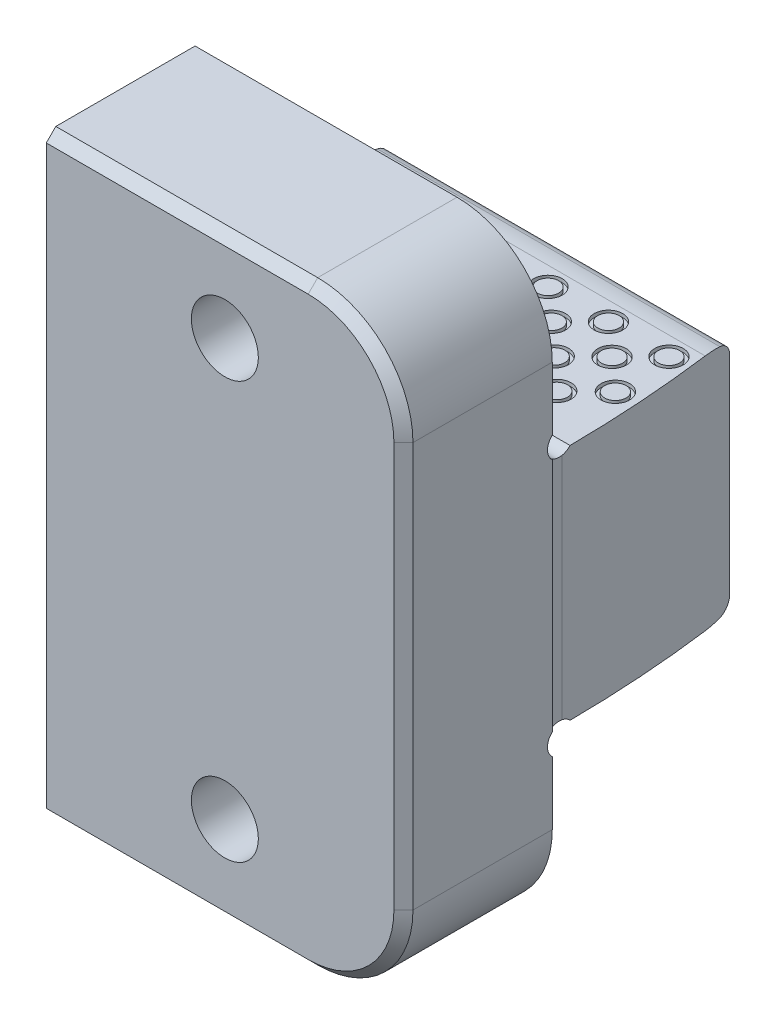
from build123d import *

# Parameters (mm, degrees)
EXTRUDE1_DEPTH             = 19.05
SKETCH7_W                  = 21.968267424
SKETCH7_H                  = 31.720833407
CUT_EXTRUDE3_DEPTH         = 0.254
SKETCH8_R                  = 1.524
CUT_EXTRUDE4_DEPTH         = 54.732233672
CUT_EXTRUDE5_DEPTH         = 54.732233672
CUT_EXTRUDE6_DEPTH         = 70.445179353
SKETCH15_R                 = 1.524
SKETCH15_R_2               = 1.143
CUT_EXTRUDE7_DEPTH         = 0.381
F_1_4_20_CBORE_D           = 7.14248
F_1_4_20_CBORE_CBORE_D     = 11.1125
F_1_4_20_CBORE_CBORE_DEPTH = 7.14502
FILLET1_R                  = 10.16
CHAMFER1_SIZE              = 1.016


with BuildPart() as part:
    # Sketch3 → Extrude1 (new, symmetric)
    with BuildSketch(Plane(origin=(0, 0, 0), x_dir=(0, 0, -1), z_dir=(1, 0, 0))):
        Polygon((-15.875, -31.75), (0, -31.75), (0, -12.69746), (20.6756, -12.69746), (20.6756, 12.69746), (0, 12.69746), (0, 31.75), (-15.875, 31.75), align=None)
    extrude(amount=EXTRUDE1_DEPTH, both=True)

    # Sketch7 → Cut-Extrude3 (cut)
    with BuildSketch(Plane(origin=(19.05, 0, 0), x_dir=(0, 0, -1), z_dir=(1, 0, 0))):
        with Locations((10.984133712, 1.307835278)):
            Rectangle(SKETCH7_W, SKETCH7_H)
    extrude(amount=-CUT_EXTRUDE3_DEPTH, mode=Mode.SUBTRACT)

    # Sketch8 → Cut-Extrude4 (cut, through all)
    with BuildSketch(Plane(origin=(19.05, 0, 0), x_dir=(0, 0, -1), z_dir=(1, 0, 0))):
        with Locations((1.016, 13.71346)):
            Circle(SKETCH8_R)
        with Locations((1.016, -13.71346)):
            Circle(SKETCH8_R)
    extrude(amount=-CUT_EXTRUDE4_DEPTH, mode=Mode.SUBTRACT)

    # Sketch9 → Cut-Extrude5 (cut, through all)
    with BuildSketch(Plane(origin=(19.05, 0, 0), x_dir=(0, 0, -1), z_dir=(1, 0, 0))):
        with BuildLine():
            Line((20.6756, 11.026976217), (23.9776, 11.026976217))
            Line((23.9776, 11.026976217), (23.9776, 17.376976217))
            Line((23.9776, 17.376976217), (17.6276, 17.376976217))
            Line((17.6276, 17.376976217), (17.6276, 12.69746))
            ThreePointArc((17.6276, 12.69746), (18.538923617, 12.653763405), (19.441885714, 12.523074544))
            ThreePointArc((19.441885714, 12.523074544), (20.327391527, 11.996558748), (20.6756, 11.026976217))
        make_face()
        with BuildLine():
            Line((23.9776, -11.026976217), (23.9776, -17.376976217))
            Line((23.9776, -17.376976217), (17.6276, -17.376976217))
            Line((17.6276, -17.376976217), (17.6276, -12.69746))
            ThreePointArc((17.6276, -12.69746), (18.538923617, -12.653763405), (19.441885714, -12.523074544))
            ThreePointArc((19.441885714, -12.523074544), (20.327391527, -11.996558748), (20.6756, -11.026976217))
            Line((20.6756, -11.026976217), (23.9776, -11.026976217))
        make_face()
    extrude(amount=-CUT_EXTRUDE5_DEPTH, mode=Mode.SUBTRACT)

    # Sketch13 → Cut-Extrude6 (cut, through all)
    with BuildSketch(Plane(origin=(0, 31.75, 0), x_dir=(1, 0, 0), z_dir=(0, 1, 0))):
        with BuildLine():
            Line((16.230078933, 26.67), (28.930078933, 26.67))
            Line((28.930078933, 26.67), (28.930078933, 1.27))
            Line((28.930078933, 1.27), (18.796, 1.27))
            ThreePointArc((18.796, 1.27), (18.152891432, 14.034638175), (16.230078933, 26.67))
        make_face()
    extrude(amount=-CUT_EXTRUDE6_DEPTH, mode=Mode.SUBTRACT)

    # Sketch15 → Cut-Extrude7 (cut)
    # profile 1 of 22: a face of its own
    with BuildSketch(Plane(origin=(0, 12.69746, 0), x_dir=(1, 0, 0), z_dir=(0, 1, 0))):
        with Locations(Location((-9.9314, 15.621, 0), (0, 0, 270))):
            Circle(SKETCH15_R)
        with Locations(Location((-9.9314, 15.621, 0), (0, 0, 270))):
            Circle(SKETCH15_R_2, mode=Mode.SUBTRACT)
    # profile 2 of 22: a face of its own
    with BuildSketch(Plane(origin=(0, 12.69746, 0), x_dir=(1, 0, 0), z_dir=(0, 1, 0))):
        with Locations(Location((-3.4798, 15.621, 0), (0, 0, 270))):
            Circle(SKETCH15_R)
        with Locations(Location((-3.4798, 15.621, 0), (0, 0, 270))):
            Circle(SKETCH15_R_2, mode=Mode.SUBTRACT)
    # profile 3 of 22: a face of its own
    with BuildSketch(Plane(origin=(0, 12.69746, 0), x_dir=(1, 0, 0), z_dir=(0, 1, 0))):
        with Locations(Location((-16.383, 15.621, 0), (0, 0, 270))):
            Circle(SKETCH15_R)
        with Locations(Location((-16.383, 15.621, 0), (0, 0, 270))):
            Circle(SKETCH15_R_2, mode=Mode.SUBTRACT)
    # profile 4 of 22: a face of its own
    with BuildSketch(Plane(origin=(0, 12.69746, 0), x_dir=(1, 0, 0), z_dir=(0, 1, 0))):
        with Locations(Location((15.875, 15.621, 0), (0, 0, 270))):
            Circle(SKETCH15_R)
        with Locations(Location((15.875, 15.621, 0), (0, 0, 270))):
            Circle(SKETCH15_R_2, mode=Mode.SUBTRACT)
    # profile 5 of 22: a face of its own
    with BuildSketch(Plane(origin=(0, 12.69746, 0), x_dir=(1, 0, 0), z_dir=(0, 1, 0))):
        with Locations(Location((9.4234, 15.621, 0), (0, 0, 270))):
            Circle(SKETCH15_R)
        with Locations(Location((9.4234, 15.621, 0), (0, 0, 270))):
            Circle(SKETCH15_R_2, mode=Mode.SUBTRACT)
    # profile 6 of 22: a face of its own
    with BuildSketch(Plane(origin=(0, 12.69746, 0), x_dir=(1, 0, 0), z_dir=(0, 1, 0))):
        with Locations(Location((2.9718, 15.621, 0), (0, 0, 270))):
            Circle(SKETCH15_R)
        with Locations(Location((2.9718, 15.621, 0), (0, 0, 270))):
            Circle(SKETCH15_R_2, mode=Mode.SUBTRACT)
    # profile 7 of 22: a face of its own
    with BuildSketch(Plane(origin=(0, 12.69746, 0), x_dir=(1, 0, 0), z_dir=(0, 1, 0))):
        with Locations(Location((-6.5786, 12.573, 0), (0, 0, 270))):
            Circle(SKETCH15_R)
        with Locations(Location((-6.5786, 12.573, 0), (0, 0, 270))):
            Circle(SKETCH15_R_2, mode=Mode.SUBTRACT)
    # profile 8 of 22: a face of its own
    with BuildSketch(Plane(origin=(0, 12.69746, 0), x_dir=(1, 0, 0), z_dir=(0, 1, 0))):
        with Locations(Location((-0.1016, 12.573, 0), (0, 0, 270))):
            Circle(SKETCH15_R)
        with Locations(Location((-0.1016, 12.573, 0), (0, 0, 270))):
            Circle(SKETCH15_R_2, mode=Mode.SUBTRACT)
    # profile 9 of 22: a face of its own
    with BuildSketch(Plane(origin=(0, 12.69746, 0), x_dir=(1, 0, 0), z_dir=(0, 1, 0))):
        with Locations(Location((-13.0556, 12.573, 0), (0, 0, 270))):
            Circle(SKETCH15_R)
        with Locations(Location((-13.0556, 12.573, 0), (0, 0, 270))):
            Circle(SKETCH15_R_2, mode=Mode.SUBTRACT)
    # profile 10 of 22: a face of its own
    with BuildSketch(Plane(origin=(0, 12.69746, 0), x_dir=(1, 0, 0), z_dir=(0, 1, 0))):
        with Locations(Location((12.8524, 12.573, 0), (0, 0, 270))):
            Circle(SKETCH15_R)
        with Locations(Location((12.8524, 12.573, 0), (0, 0, 270))):
            Circle(SKETCH15_R_2, mode=Mode.SUBTRACT)
    # profile 11 of 22: a face of its own
    with BuildSketch(Plane(origin=(0, 12.69746, 0), x_dir=(1, 0, 0), z_dir=(0, 1, 0))):
        with Locations(Location((6.3754, 12.573, 0), (0, 0, 270))):
            Circle(SKETCH15_R)
        with Locations(Location((6.3754, 12.573, 0), (0, 0, 270))):
            Circle(SKETCH15_R_2, mode=Mode.SUBTRACT)
    # profile 12 of 22: a face of its own
    with BuildSketch(Plane(origin=(0, 12.69746, 0), x_dir=(1, 0, 0), z_dir=(0, 1, 0))):
        with Locations(Location((-9.8552, 9.525, 0), (0, 0, 270))):
            Circle(SKETCH15_R)
        with Locations(Location((-9.8552, 9.525, 0), (0, 0, 270))):
            Circle(SKETCH15_R_2, mode=Mode.SUBTRACT)
    # profile 13 of 22: a face of its own
    with BuildSketch(Plane(origin=(0, 12.69746, 0), x_dir=(1, 0, 0), z_dir=(0, 1, 0))):
        with Locations(Location((-3.3274, 9.525, 0), (0, 0, 270))):
            Circle(SKETCH15_R)
        with Locations(Location((-3.3274, 9.525, 0), (0, 0, 270))):
            Circle(SKETCH15_R_2, mode=Mode.SUBTRACT)
    # profile 14 of 22: a face of its own
    with BuildSketch(Plane(origin=(0, 12.69746, 0), x_dir=(1, 0, 0), z_dir=(0, 1, 0))):
        with Locations(Location((-16.383, 9.525, 0), (0, 0, 270))):
            Circle(SKETCH15_R)
        with Locations(Location((-16.383, 9.525, 0), (0, 0, 270))):
            Circle(SKETCH15_R_2, mode=Mode.SUBTRACT)
    # profile 15 of 22: a face of its own
    with BuildSketch(Plane(origin=(0, 12.69746, 0), x_dir=(1, 0, 0), z_dir=(0, 1, 0))):
        with Locations(Location((16.256, 9.525, 0), (0, 0, 270))):
            Circle(SKETCH15_R)
        with Locations(Location((16.256, 9.525, 0), (0, 0, 270))):
            Circle(SKETCH15_R_2, mode=Mode.SUBTRACT)
    # profile 16 of 22: a face of its own
    with BuildSketch(Plane(origin=(0, 12.69746, 0), x_dir=(1, 0, 0), z_dir=(0, 1, 0))):
        with Locations(Location((9.7282, 9.525, 0), (0, 0, 270))):
            Circle(SKETCH15_R)
        with Locations(Location((9.7282, 9.525, 0), (0, 0, 270))):
            Circle(SKETCH15_R_2, mode=Mode.SUBTRACT)
    # profile 17 of 22: a face of its own
    with BuildSketch(Plane(origin=(0, 12.69746, 0), x_dir=(1, 0, 0), z_dir=(0, 1, 0))):
        with Locations(Location((3.2004, 9.525, 0), (0, 0, 270))):
            Circle(SKETCH15_R)
        with Locations(Location((3.2004, 9.525, 0), (0, 0, 270))):
            Circle(SKETCH15_R_2, mode=Mode.SUBTRACT)
    # profile 18 of 22: a face of its own
    with BuildSketch(Plane(origin=(0, 12.69746, 0), x_dir=(1, 0, 0), z_dir=(0, 1, 0))):
        with Locations(Location((-6.5278, 6.477, 0), (0, 0, 270))):
            Circle(SKETCH15_R)
        with Locations(Location((-6.5278, 6.477, 0), (0, 0, 270))):
            Circle(SKETCH15_R_2, mode=Mode.SUBTRACT)
    # profile 19 of 22: a face of its own
    with BuildSketch(Plane(origin=(0, 12.69746, 0), x_dir=(1, 0, 0), z_dir=(0, 1, 0))):
        with Locations(Location((0, 6.477, 0), (0, 0, 270))):
            Circle(SKETCH15_R)
        with Locations(Location((0, 6.477, 0), (0, 0, 270))):
            Circle(SKETCH15_R_2, mode=Mode.SUBTRACT)
    # profile 20 of 22: a face of its own
    with BuildSketch(Plane(origin=(0, 12.69746, 0), x_dir=(1, 0, 0), z_dir=(0, 1, 0))):
        with Locations(Location((-13.0556, 6.477, 0), (0, 0, 270))):
            Circle(SKETCH15_R)
        with Locations(Location((-13.0556, 6.477, 0), (0, 0, 270))):
            Circle(SKETCH15_R_2, mode=Mode.SUBTRACT)
    # profile 21 of 22: a face of its own
    with BuildSketch(Plane(origin=(0, 12.69746, 0), x_dir=(1, 0, 0), z_dir=(0, 1, 0))):
        with Locations(Location((13.0556, 6.477, 0), (0, 0, 270))):
            Circle(SKETCH15_R)
        with Locations(Location((13.0556, 6.477, 0), (0, 0, 270))):
            Circle(SKETCH15_R_2, mode=Mode.SUBTRACT)
    # profile 22 of 22: a face of its own
    with BuildSketch(Plane(origin=(0, 12.69746, 0), x_dir=(1, 0, 0), z_dir=(0, 1, 0))):
        with Locations(Location((6.5278, 6.477, 0), (0, 0, 270))):
            Circle(SKETCH15_R)
        with Locations(Location((6.5278, 6.477, 0), (0, 0, 270))):
            Circle(SKETCH15_R_2, mode=Mode.SUBTRACT)
    cut_extrude7 = extrude(amount=-CUT_EXTRUDE7_DEPTH, mode=Mode.SUBTRACT)

    # Mirror1: Cut-Extrude7 across plane
    add(cut_extrude7.mirror(Plane.ZX), mode=Mode.SUBTRACT)

    # 1_4_-20 CBORE (through all)
    with Locations(Plane(origin=(0, 0, 0), x_dir=(-1, 0, 0), z_dir=(0, 0, -1))):
        with Locations((0, 22.225), (0, -22.225)):
            CounterBoreHole(F_1_4_20_CBORE_D / 2, F_1_4_20_CBORE_CBORE_D / 2, F_1_4_20_CBORE_CBORE_DEPTH)

    # Fillet1
    fillet1_edges = [part.edges().sort_by_distance(p)[0] for p in [
        (19.05, 31.75, 7.9375),
        (19.05, -31.75, 7.9375),
    ]]
    fillet(fillet1_edges, radius=FILLET1_R)

    # Chamfer1
    chamfer1_edges = [part.edges().sort_by_distance(p)[0] for p in [
        (19.05, 0, 15.875),
        (-5.08, -31.75, 15.875),
        (-5.08, 31.75, 15.875),
        (16.074204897, 28.774204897, 15.875),
        (16.074204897, -28.774204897, 15.875),
    ]]
    chamfer(chamfer1_edges, length=CHAMFER1_SIZE)


solid = part.part
